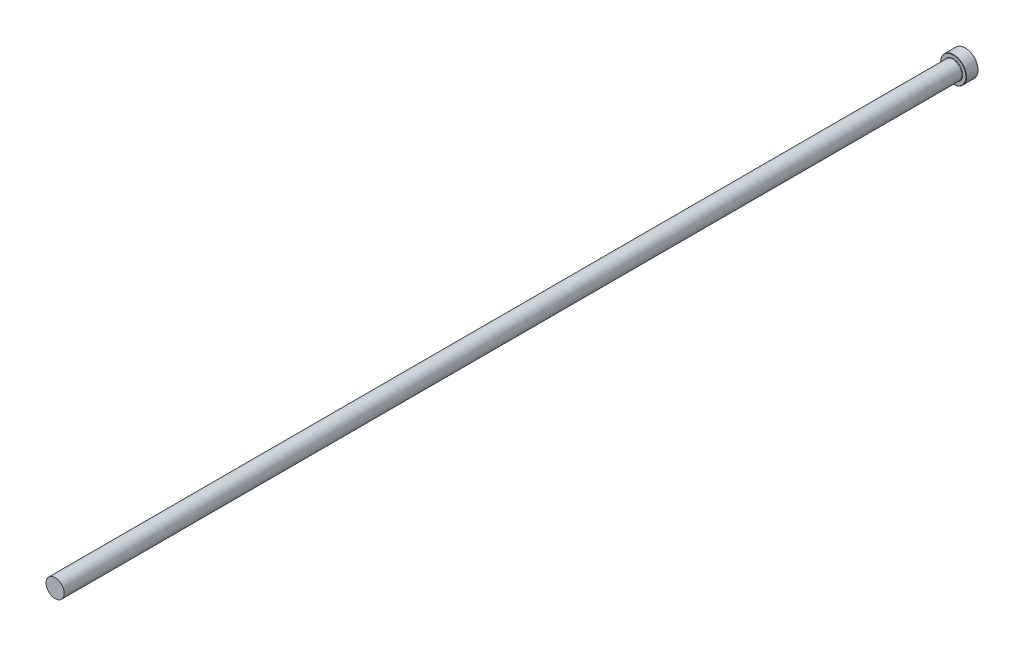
ISO-10303-21;
HEADER;
FILE_DESCRIPTION(('STEP AP214'),'2;1');
FILE_NAME('part.step','',(''),(''),'','','');
FILE_SCHEMA(('AUTOMOTIVE_DESIGN { 1 0 10303 214 1 1 1 1 }'));
ENDSEC;
DATA;
#1=APPLICATION_CONTEXT('core data for automotive mechanical design processes');
#2=APPLICATION_PROTOCOL_DEFINITION('international standard','automotive_design',2000,#1);
#3=PRODUCT_CONTEXT('',#1,'mechanical');
#4=PRODUCT('Part','Part','',(#3));
#5=PRODUCT_RELATED_PRODUCT_CATEGORY('part','',(#4));
#6=PRODUCT_DEFINITION_FORMATION('','',#4);
#7=PRODUCT_DEFINITION_CONTEXT('part definition',#1,'design');
#8=PRODUCT_DEFINITION('design','',#6,#7);
#9=PRODUCT_DEFINITION_SHAPE('','',#8);
#10=(LENGTH_UNIT() NAMED_UNIT(*) SI_UNIT(.MILLI.,.METRE.));
#11=(NAMED_UNIT(*) PLANE_ANGLE_UNIT() SI_UNIT($,.RADIAN.));
#12=(NAMED_UNIT(*) SI_UNIT($,.STERADIAN.) SOLID_ANGLE_UNIT());
#13=UNCERTAINTY_MEASURE_WITH_UNIT(LENGTH_MEASURE(1.E-05),#10,'distance_accuracy_value','');
#14=(GEOMETRIC_REPRESENTATION_CONTEXT(3) GLOBAL_UNCERTAINTY_ASSIGNED_CONTEXT((#13)) GLOBAL_UNIT_ASSIGNED_CONTEXT((#10,
#11,#12)) REPRESENTATION_CONTEXT('',''));
#15=CARTESIAN_POINT('',(0.,0.,0.));
#16=DIRECTION('',(0.,0.,1.));
#17=DIRECTION('',(1.,0.,0.));
#18=AXIS2_PLACEMENT_3D('',#15,#16,#17);
#19=CARTESIAN_POINT('',(0.,5.99999999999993,600.));
#20=DIRECTION('',(0.,0.,-1.));
#21=DIRECTION('',(-1.,0.,0.));
#22=AXIS2_PLACEMENT_3D('',#19,#20,#21);
#23=PLANE('',#22);
#24=CARTESIAN_POINT('',(0.,0.,600.));
#25=DIRECTION('',(0.,0.,1.));
#26=DIRECTION('',(1.,0.,0.));
#27=AXIS2_PLACEMENT_3D('',#24,#25,#26);
#28=CIRCLE('',#27,5.99999999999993);
#29=CARTESIAN_POINT('',(5.99999999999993,0.,600.));
#30=VERTEX_POINT('',#29);
#31=EDGE_CURVE('E50',#30,#30,#28,.T.);
#32=ORIENTED_EDGE('',*,*,#31,.T.);
#33=EDGE_LOOP('',(#32));
#34=FACE_BOUND('',#33,.T.);
#35=ADVANCED_FACE('F30',(#34),#23,.F.);
#36=CARTESIAN_POINT('',(0.,0.,109.050628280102));
#37=DIRECTION('',(0.,0.,1.));
#38=DIRECTION('',(1.,0.,0.));
#39=AXIS2_PLACEMENT_3D('',#36,#37,#38);
#40=CYLINDRICAL_SURFACE('',#39,5.99999999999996);
#41=ORIENTED_EDGE('',*,*,#31,.F.);
#42=EDGE_LOOP('',(#41));
#43=FACE_BOUND('',#42,.T.);
#44=CARTESIAN_POINT('',(0.,0.,8.3));
#45=DIRECTION('',(0.,0.,1.));
#46=DIRECTION('',(1.,0.,0.));
#47=AXIS2_PLACEMENT_3D('',#44,#45,#46);
#48=CIRCLE('',#47,6.);
#49=CARTESIAN_POINT('',(6.,0.,8.3));
#50=VERTEX_POINT('',#49);
#51=EDGE_CURVE('E53',#50,#50,#48,.T.);
#52=ORIENTED_EDGE('',*,*,#51,.T.);
#53=EDGE_LOOP('',(#52));
#54=FACE_BOUND('',#53,.T.);
#55=ADVANCED_FACE('F73',(#43,#54),#40,.T.);
#56=CARTESIAN_POINT('',(0.,0.,8.3));
#57=DIRECTION('',(0.,0.,1.));
#58=DIRECTION('',(1.,0.,0.));
#59=AXIS2_PLACEMENT_3D('',#56,#57,#58);
#60=TOROIDAL_SURFACE('',#59,6.3,0.3);
#61=ORIENTED_EDGE('',*,*,#51,.F.);
#62=EDGE_LOOP('',(#61));
#63=FACE_BOUND('',#62,.T.);
#64=CARTESIAN_POINT('',(0.,0.,8.00000000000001));
#65=DIRECTION('',(0.,0.,1.));
#66=DIRECTION('',(1.,0.,0.));
#67=AXIS2_PLACEMENT_3D('',#64,#65,#66);
#68=CIRCLE('',#67,6.3);
#69=CARTESIAN_POINT('',(6.3,0.,8.00000000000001));
#70=VERTEX_POINT('',#69);
#71=EDGE_CURVE('E56',#70,#70,#68,.T.);
#72=ORIENTED_EDGE('',*,*,#71,.T.);
#73=EDGE_LOOP('',(#72));
#74=FACE_BOUND('',#73,.T.);
#75=ADVANCED_FACE('F60',(#63,#74),#60,.F.);
#76=CARTESIAN_POINT('',(0.,8.5,8.));
#77=DIRECTION('',(0.,0.,-1.));
#78=DIRECTION('',(-1.,0.,0.));
#79=AXIS2_PLACEMENT_3D('',#76,#77,#78);
#80=PLANE('',#79);
#81=CARTESIAN_POINT('',(0.,0.,8.));
#82=DIRECTION('',(0.,0.,-1.));
#83=DIRECTION('',(-1.,0.,0.));
#84=AXIS2_PLACEMENT_3D('',#81,#82,#83);
#85=CIRCLE('',#84,8.29999999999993);
#86=CARTESIAN_POINT('',(-8.29999999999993,0.,8.));
#87=VERTEX_POINT('',#86);
#88=EDGE_CURVE('E10',#87,#87,#85,.F.);
#89=ORIENTED_EDGE('',*,*,#88,.T.);
#90=EDGE_LOOP('',(#89));
#91=FACE_BOUND('',#90,.T.);
#92=ORIENTED_EDGE('',*,*,#71,.F.);
#93=EDGE_LOOP('',(#92));
#94=FACE_BOUND('',#93,.T.);
#95=ADVANCED_FACE('F62',(#91,#94),#80,.F.);
#96=CARTESIAN_POINT('',(0.,0.,109.050628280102));
#97=DIRECTION('',(0.,0.,1.));
#98=DIRECTION('',(1.,0.,0.));
#99=AXIS2_PLACEMENT_3D('',#96,#97,#98);
#100=CYLINDRICAL_SURFACE('',#99,8.5);
#101=CARTESIAN_POINT('',(0.,0.,0.199999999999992));
#102=DIRECTION('',(0.,0.,1.));
#103=DIRECTION('',(1.,0.,0.));
#104=AXIS2_PLACEMENT_3D('',#101,#102,#103);
#105=CIRCLE('',#104,8.5);
#106=CARTESIAN_POINT('',(8.5,0.,0.199999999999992));
#107=VERTEX_POINT('',#106);
#108=EDGE_CURVE('E41',#107,#107,#105,.T.);
#109=ORIENTED_EDGE('',*,*,#108,.T.);
#110=EDGE_LOOP('',(#109));
#111=FACE_BOUND('',#110,.T.);
#112=CARTESIAN_POINT('',(0.,0.,7.79999999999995));
#113=DIRECTION('',(0.,0.,-1.));
#114=DIRECTION('',(-1.,0.,0.));
#115=AXIS2_PLACEMENT_3D('',#112,#113,#114);
#116=CIRCLE('',#115,8.5);
#117=CARTESIAN_POINT('',(-8.5,0.,7.79999999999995));
#118=VERTEX_POINT('',#117);
#119=EDGE_CURVE('E45',#118,#118,#116,.T.);
#120=ORIENTED_EDGE('',*,*,#119,.T.);
#121=EDGE_LOOP('',(#120));
#122=FACE_BOUND('',#121,.T.);
#123=ADVANCED_FACE('F64',(#111,#122),#100,.T.);
#124=CARTESIAN_POINT('',(0.,0.,0.));
#125=DIRECTION('',(0.,0.,1.));
#126=DIRECTION('',(1.,0.,0.));
#127=AXIS2_PLACEMENT_3D('',#124,#125,#126);
#128=PLANE('',#127);
#129=CARTESIAN_POINT('',(0.,0.,0.));
#130=DIRECTION('',(0.,0.,1.));
#131=DIRECTION('',(1.,0.,0.));
#132=AXIS2_PLACEMENT_3D('',#129,#130,#131);
#133=CIRCLE('',#132,8.30000000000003);
#134=CARTESIAN_POINT('',(8.30000000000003,0.,0.));
#135=VERTEX_POINT('',#134);
#136=EDGE_CURVE('E37',#135,#135,#133,.F.);
#137=ORIENTED_EDGE('',*,*,#136,.T.);
#138=EDGE_LOOP('',(#137));
#139=FACE_BOUND('',#138,.T.);
#140=ADVANCED_FACE('F70',(#139),#128,.F.);
#141=CARTESIAN_POINT('',(0.,0.,0.199999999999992));
#142=DIRECTION('',(0.,0.,1.));
#143=DIRECTION('',(1.,0.,0.));
#144=AXIS2_PLACEMENT_3D('',#141,#142,#143);
#145=CONICAL_SURFACE('',#144,8.5,0.785398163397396);
#146=ORIENTED_EDGE('',*,*,#136,.F.);
#147=EDGE_LOOP('',(#146));
#148=FACE_BOUND('',#147,.T.);
#149=ORIENTED_EDGE('',*,*,#108,.F.);
#150=EDGE_LOOP('',(#149));
#151=FACE_BOUND('',#150,.T.);
#152=ADVANCED_FACE('F84',(#148,#151),#145,.T.);
#153=CARTESIAN_POINT('',(0.,0.,8.00000000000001));
#154=DIRECTION('',(0.,0.,-1.));
#155=DIRECTION('',(-1.,0.,0.));
#156=AXIS2_PLACEMENT_3D('',#153,#154,#155);
#157=CONICAL_SURFACE('',#156,8.29999999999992,0.7853981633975);
#158=ORIENTED_EDGE('',*,*,#119,.F.);
#159=EDGE_LOOP('',(#158));
#160=FACE_BOUND('',#159,.T.);
#161=ORIENTED_EDGE('',*,*,#88,.F.);
#162=EDGE_LOOP('',(#161));
#163=FACE_BOUND('',#162,.T.);
#164=ADVANCED_FACE('F32',(#160,#163),#157,.T.);
#165=CLOSED_SHELL('',(#35,#55,#75,#95,#123,#140,#152,#164));
#166=MANIFOLD_SOLID_BREP('B2',#165);
#167=ADVANCED_BREP_SHAPE_REPRESENTATION('',(#18,#166),#14);
#168=SHAPE_DEFINITION_REPRESENTATION(#9,#167);
ENDSEC;
END-ISO-10303-21;
